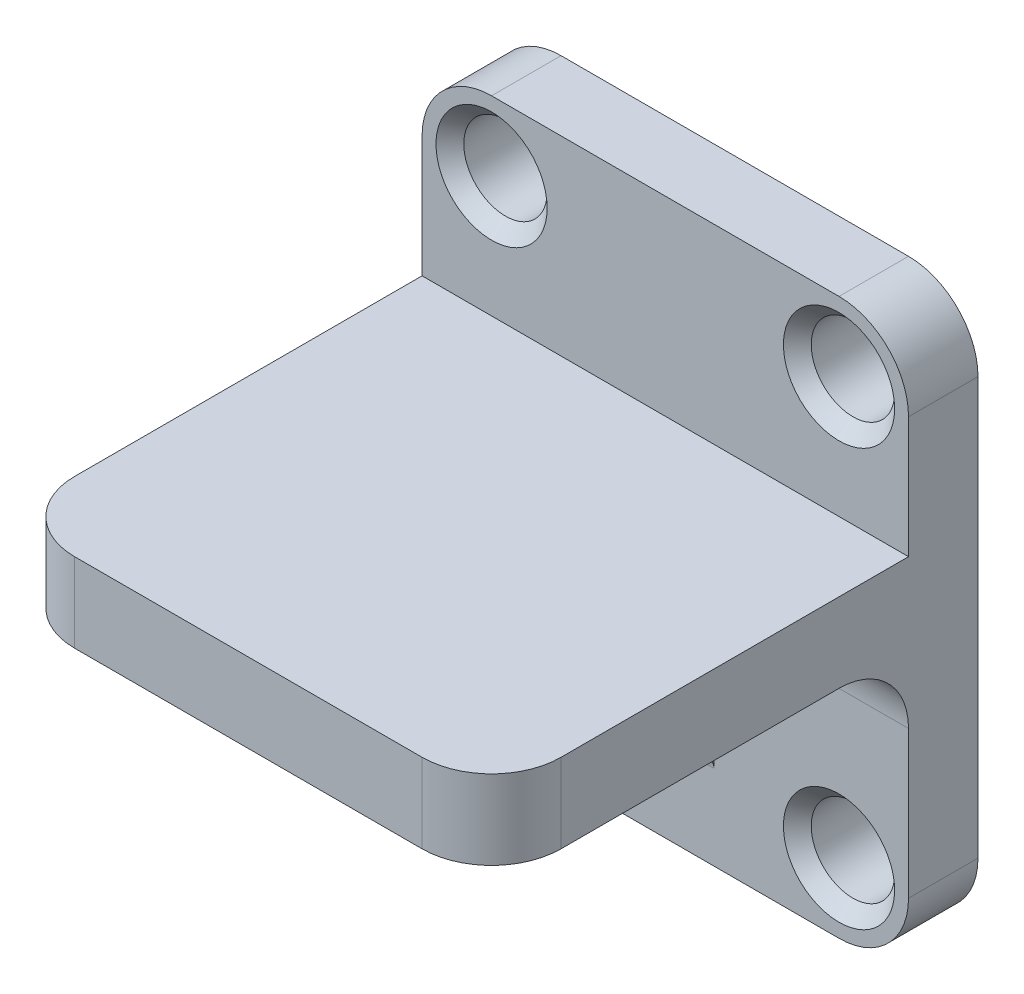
ISO-10303-21;
HEADER;
FILE_DESCRIPTION(('STEP AP214'),'2;1');
FILE_NAME('part.step','',(''),(''),'','','');
FILE_SCHEMA(('AUTOMOTIVE_DESIGN { 1 0 10303 214 1 1 1 1 }'));
ENDSEC;
DATA;
#1=APPLICATION_CONTEXT('core data for automotive mechanical design processes');
#2=APPLICATION_PROTOCOL_DEFINITION('international standard','automotive_design',2000,#1);
#3=PRODUCT_CONTEXT('',#1,'mechanical');
#4=PRODUCT('Part','Part','',(#3));
#5=PRODUCT_RELATED_PRODUCT_CATEGORY('part','',(#4));
#6=PRODUCT_DEFINITION_FORMATION('','',#4);
#7=PRODUCT_DEFINITION_CONTEXT('part definition',#1,'design');
#8=PRODUCT_DEFINITION('design','',#6,#7);
#9=PRODUCT_DEFINITION_SHAPE('','',#8);
#10=(LENGTH_UNIT() NAMED_UNIT(*) SI_UNIT(.MILLI.,.METRE.));
#11=(NAMED_UNIT(*) PLANE_ANGLE_UNIT() SI_UNIT($,.RADIAN.));
#12=(NAMED_UNIT(*) SI_UNIT($,.STERADIAN.) SOLID_ANGLE_UNIT());
#13=UNCERTAINTY_MEASURE_WITH_UNIT(LENGTH_MEASURE(1.E-05),#10,'distance_accuracy_value','');
#14=(GEOMETRIC_REPRESENTATION_CONTEXT(3) GLOBAL_UNCERTAINTY_ASSIGNED_CONTEXT((#13)) GLOBAL_UNIT_ASSIGNED_CONTEXT((#10,
#11,#12)) REPRESENTATION_CONTEXT('',''));
#15=CARTESIAN_POINT('',(0.,0.,0.));
#16=DIRECTION('',(0.,0.,1.));
#17=DIRECTION('',(1.,0.,0.));
#18=AXIS2_PLACEMENT_3D('',#15,#16,#17);
#19=CARTESIAN_POINT('',(60.,70.,10.));
#20=DIRECTION('',(0.,0.,1.));
#21=DIRECTION('',(1.,0.,0.));
#22=AXIS2_PLACEMENT_3D('',#19,#20,#21);
#23=PLANE('',#22);
#24=DIRECTION('',(0.,-1.,0.));
#25=VECTOR('',#24,1.);
#26=CARTESIAN_POINT('',(0.,10.0000000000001,10.));
#27=LINE('',#26,#25);
#28=CARTESIAN_POINT('',(0.,69.9999999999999,10.));
#29=VERTEX_POINT('',#28);
#30=CARTESIAN_POINT('',(0.,52.5636894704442,10.));
#31=VERTEX_POINT('',#30);
#32=EDGE_CURVE('E270',#29,#31,#27,.T.);
#33=ORIENTED_EDGE('',*,*,#32,.T.);
#34=DIRECTION('',(-1.,0.,0.));
#35=VECTOR('',#34,1.);
#36=CARTESIAN_POINT('',(0.,52.5636894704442,10.));
#37=LINE('',#36,#35);
#38=CARTESIAN_POINT('',(70.,52.5636894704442,10.));
#39=VERTEX_POINT('',#38);
#40=EDGE_CURVE('E189',#39,#31,#37,.T.);
#41=ORIENTED_EDGE('',*,*,#40,.F.);
#42=DIRECTION('',(0.,1.,0.));
#43=VECTOR('',#42,1.);
#44=CARTESIAN_POINT('',(70.,10.0000000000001,10.));
#45=LINE('',#44,#43);
#46=CARTESIAN_POINT('',(70.,69.9999999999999,10.));
#47=VERTEX_POINT('',#46);
#48=EDGE_CURVE('E291',#39,#47,#45,.T.);
#49=ORIENTED_EDGE('',*,*,#48,.T.);
#50=CARTESIAN_POINT('',(60.,70.,10.));
#51=DIRECTION('',(0.,0.,1.));
#52=DIRECTION('',(1.,0.,0.));
#53=AXIS2_PLACEMENT_3D('',#50,#51,#52);
#54=CIRCLE('',#53,9.99999999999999);
#55=CARTESIAN_POINT('',(59.9999999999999,80.,10.));
#56=VERTEX_POINT('',#55);
#57=EDGE_CURVE('E315',#47,#56,#54,.T.);
#58=ORIENTED_EDGE('',*,*,#57,.T.);
#59=DIRECTION('',(-1.,0.,0.));
#60=VECTOR('',#59,1.);
#61=CARTESIAN_POINT('',(10.0000000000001,80.,10.));
#62=LINE('',#61,#60);
#63=CARTESIAN_POINT('',(10.0000000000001,80.,10.));
#64=VERTEX_POINT('',#63);
#65=EDGE_CURVE('E381',#56,#64,#62,.T.);
#66=ORIENTED_EDGE('',*,*,#65,.T.);
#67=CARTESIAN_POINT('',(10.,70.,10.));
#68=DIRECTION('',(0.,0.,1.));
#69=DIRECTION('',(-1.,0.,0.));
#70=AXIS2_PLACEMENT_3D('',#67,#68,#69);
#71=CIRCLE('',#70,10.);
#72=EDGE_CURVE('E271',#64,#29,#71,.T.);
#73=ORIENTED_EDGE('',*,*,#72,.T.);
#74=EDGE_LOOP('',(#33,#41,#49,#58,#66,#73));
#75=FACE_BOUND('',#74,.T.);
#76=CARTESIAN_POINT('',(10.,70.,10.));
#77=DIRECTION('',(0.,0.,1.));
#78=DIRECTION('',(1.,0.,0.));
#79=AXIS2_PLACEMENT_3D('',#76,#77,#78);
#80=CIRCLE('',#79,7.99999999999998);
#81=CARTESIAN_POINT('',(18.,70.,10.));
#82=VERTEX_POINT('',#81);
#83=EDGE_CURVE('E256',#82,#82,#80,.F.);
#84=ORIENTED_EDGE('',*,*,#83,.T.);
#85=EDGE_LOOP('',(#84));
#86=FACE_BOUND('',#85,.T.);
#87=CARTESIAN_POINT('',(60.,70.,10.));
#88=DIRECTION('',(0.,0.,1.));
#89=DIRECTION('',(1.,0.,0.));
#90=AXIS2_PLACEMENT_3D('',#87,#88,#89);
#91=CIRCLE('',#90,7.99999999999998);
#92=CARTESIAN_POINT('',(68.,70.,10.));
#93=VERTEX_POINT('',#92);
#94=EDGE_CURVE('E253',#93,#93,#91,.F.);
#95=ORIENTED_EDGE('',*,*,#94,.T.);
#96=EDGE_LOOP('',(#95));
#97=FACE_BOUND('',#96,.T.);
#98=ADVANCED_FACE('F32',(#75,#86,#97),#23,.T.);
#99=DIRECTION('',(0.,-1.,0.));
#100=VECTOR('',#99,1.);
#101=CARTESIAN_POINT('',(42.,70.,10.));
#102=LINE('',#101,#100);
#103=CARTESIAN_POINT('',(42.,31.1526320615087,10.));
#104=VERTEX_POINT('',#103);
#105=CARTESIAN_POINT('',(42.,12.1838850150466,10.));
#106=VERTEX_POINT('',#105);
#107=EDGE_CURVE('E47',#104,#106,#102,.T.);
#108=ORIENTED_EDGE('',*,*,#107,.T.);
#109=DIRECTION('',(-1.,0.,0.));
#110=VECTOR('',#109,1.);
#111=CARTESIAN_POINT('',(28.,12.1838850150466,10.));
#112=LINE('',#111,#110);
#113=CARTESIAN_POINT('',(28.,12.1838850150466,10.));
#114=VERTEX_POINT('',#113);
#115=EDGE_CURVE('E415',#106,#114,#112,.T.);
#116=ORIENTED_EDGE('',*,*,#115,.T.);
#117=DIRECTION('',(0.,-1.,0.));
#118=VECTOR('',#117,1.);
#119=CARTESIAN_POINT('',(28.,70.,10.));
#120=LINE('',#119,#118);
#121=CARTESIAN_POINT('',(28.,31.1526320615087,10.));
#122=VERTEX_POINT('',#121);
#123=EDGE_CURVE('E54',#122,#114,#120,.T.);
#124=ORIENTED_EDGE('',*,*,#123,.F.);
#125=DIRECTION('',(1.,0.,0.));
#126=VECTOR('',#125,1.);
#127=CARTESIAN_POINT('',(60.,31.1526320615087,10.));
#128=LINE('',#127,#126);
#129=CARTESIAN_POINT('',(0.,31.1526320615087,10.));
#130=VERTEX_POINT('',#129);
#131=EDGE_CURVE('E266',#122,#130,#128,.F.);
#132=ORIENTED_EDGE('',*,*,#131,.T.);
#133=CARTESIAN_POINT('',(0.,10.0000000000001,10.));
#134=VERTEX_POINT('',#133);
#135=EDGE_CURVE('E267',#130,#134,#27,.T.);
#136=ORIENTED_EDGE('',*,*,#135,.T.);
#137=CARTESIAN_POINT('',(10.,10.,10.));
#138=DIRECTION('',(0.,0.,1.));
#139=DIRECTION('',(-1.,0.,0.));
#140=AXIS2_PLACEMENT_3D('',#137,#138,#139);
#141=CIRCLE('',#140,10.);
#142=CARTESIAN_POINT('',(10.0000000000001,0.,10.));
#143=VERTEX_POINT('',#142);
#144=EDGE_CURVE('E277',#134,#143,#141,.T.);
#145=ORIENTED_EDGE('',*,*,#144,.T.);
#146=DIRECTION('',(1.,0.,0.));
#147=VECTOR('',#146,1.);
#148=CARTESIAN_POINT('',(10.0000000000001,0.,10.));
#149=LINE('',#148,#147);
#150=CARTESIAN_POINT('',(59.9999999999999,0.,10.));
#151=VERTEX_POINT('',#150);
#152=EDGE_CURVE('E399',#143,#151,#149,.T.);
#153=ORIENTED_EDGE('',*,*,#152,.T.);
#154=CARTESIAN_POINT('',(60.,10.,10.));
#155=DIRECTION('',(0.,0.,1.));
#156=DIRECTION('',(1.,0.,0.));
#157=AXIS2_PLACEMENT_3D('',#154,#155,#156);
#158=CIRCLE('',#157,10.);
#159=CARTESIAN_POINT('',(70.,10.0000000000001,10.));
#160=VERTEX_POINT('',#159);
#161=EDGE_CURVE('E295',#151,#160,#158,.T.);
#162=ORIENTED_EDGE('',*,*,#161,.T.);
#163=CARTESIAN_POINT('',(70.,31.1526320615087,10.));
#164=VERTEX_POINT('',#163);
#165=EDGE_CURVE('E286',#160,#164,#45,.T.);
#166=ORIENTED_EDGE('',*,*,#165,.T.);
#167=DIRECTION('',(1.,0.,0.));
#168=VECTOR('',#167,1.);
#169=CARTESIAN_POINT('',(60.,31.1526320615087,10.));
#170=LINE('',#169,#168);
#171=EDGE_CURVE('E407',#164,#104,#170,.F.);
#172=ORIENTED_EDGE('',*,*,#171,.T.);
#173=EDGE_LOOP('',(#108,#116,#124,#132,#136,#145,#153,#162,#166,#172));
#174=FACE_BOUND('',#173,.T.);
#175=CARTESIAN_POINT('',(60.,10.,10.));
#176=DIRECTION('',(0.,0.,1.));
#177=DIRECTION('',(1.,0.,0.));
#178=AXIS2_PLACEMENT_3D('',#175,#176,#177);
#179=CIRCLE('',#178,7.99999999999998);
#180=CARTESIAN_POINT('',(68.,10.,10.));
#181=VERTEX_POINT('',#180);
#182=EDGE_CURVE('E244',#181,#181,#179,.F.);
#183=ORIENTED_EDGE('',*,*,#182,.T.);
#184=EDGE_LOOP('',(#183));
#185=FACE_BOUND('',#184,.T.);
#186=CARTESIAN_POINT('',(10.,10.,10.));
#187=DIRECTION('',(0.,0.,1.));
#188=DIRECTION('',(1.,0.,0.));
#189=AXIS2_PLACEMENT_3D('',#186,#187,#188);
#190=CIRCLE('',#189,7.99999999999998);
#191=CARTESIAN_POINT('',(18.,10.,10.));
#192=VERTEX_POINT('',#191);
#193=EDGE_CURVE('E241',#192,#192,#190,.F.);
#194=ORIENTED_EDGE('',*,*,#193,.T.);
#195=EDGE_LOOP('',(#194));
#196=FACE_BOUND('',#195,.T.);
#197=ADVANCED_FACE('F401',(#174,#185,#196),#23,.T.);
#198=CARTESIAN_POINT('',(60.,70.,0.));
#199=DIRECTION('',(0.,0.,1.));
#200=DIRECTION('',(1.,0.,0.));
#201=AXIS2_PLACEMENT_3D('',#198,#199,#200);
#202=PLANE('',#201);
#203=CARTESIAN_POINT('',(10.,10.,0.));
#204=DIRECTION('',(0.,0.,1.));
#205=DIRECTION('',(1.,0.,0.));
#206=AXIS2_PLACEMENT_3D('',#203,#204,#205);
#207=CIRCLE('',#206,6.);
#208=CARTESIAN_POINT('',(16.,10.,0.));
#209=VERTEX_POINT('',#208);
#210=EDGE_CURVE('E507',#209,#209,#207,.T.);
#211=ORIENTED_EDGE('',*,*,#210,.T.);
#212=EDGE_LOOP('',(#211));
#213=FACE_BOUND('',#212,.T.);
#214=CARTESIAN_POINT('',(10.,70.,0.));
#215=DIRECTION('',(0.,0.,1.));
#216=DIRECTION('',(1.,0.,0.));
#217=AXIS2_PLACEMENT_3D('',#214,#215,#216);
#218=CIRCLE('',#217,6.);
#219=CARTESIAN_POINT('',(16.,70.,0.));
#220=VERTEX_POINT('',#219);
#221=EDGE_CURVE('E301',#220,#220,#218,.T.);
#222=ORIENTED_EDGE('',*,*,#221,.T.);
#223=EDGE_LOOP('',(#222));
#224=FACE_BOUND('',#223,.T.);
#225=CARTESIAN_POINT('',(10.,70.,0.));
#226=DIRECTION('',(0.,0.,1.));
#227=DIRECTION('',(-1.,0.,0.));
#228=AXIS2_PLACEMENT_3D('',#225,#226,#227);
#229=CIRCLE('',#228,10.);
#230=CARTESIAN_POINT('',(10.0000000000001,80.,0.));
#231=VERTEX_POINT('',#230);
#232=CARTESIAN_POINT('',(0.,69.9999999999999,0.));
#233=VERTEX_POINT('',#232);
#234=EDGE_CURVE('E303',#231,#233,#229,.T.);
#235=ORIENTED_EDGE('',*,*,#234,.F.);
#236=DIRECTION('',(-1.,0.,0.));
#237=VECTOR('',#236,1.);
#238=CARTESIAN_POINT('',(10.0000000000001,80.,0.));
#239=LINE('',#238,#237);
#240=CARTESIAN_POINT('',(59.9999999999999,80.,0.));
#241=VERTEX_POINT('',#240);
#242=EDGE_CURVE('E300',#241,#231,#239,.T.);
#243=ORIENTED_EDGE('',*,*,#242,.F.);
#244=CARTESIAN_POINT('',(60.,70.,0.));
#245=DIRECTION('',(0.,0.,1.));
#246=DIRECTION('',(1.,0.,0.));
#247=AXIS2_PLACEMENT_3D('',#244,#245,#246);
#248=CIRCLE('',#247,9.99999999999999);
#249=CARTESIAN_POINT('',(70.,69.9999999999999,0.));
#250=VERTEX_POINT('',#249);
#251=EDGE_CURVE('E296',#250,#241,#248,.T.);
#252=ORIENTED_EDGE('',*,*,#251,.F.);
#253=DIRECTION('',(0.,1.,0.));
#254=VECTOR('',#253,1.);
#255=CARTESIAN_POINT('',(70.,10.0000000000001,0.));
#256=LINE('',#255,#254);
#257=CARTESIAN_POINT('',(70.,10.0000000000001,0.));
#258=VERTEX_POINT('',#257);
#259=EDGE_CURVE('E313',#258,#250,#256,.T.);
#260=ORIENTED_EDGE('',*,*,#259,.F.);
#261=CARTESIAN_POINT('',(60.,10.,0.));
#262=DIRECTION('',(0.,0.,1.));
#263=DIRECTION('',(1.,0.,0.));
#264=AXIS2_PLACEMENT_3D('',#261,#262,#263);
#265=CIRCLE('',#264,10.);
#266=CARTESIAN_POINT('',(59.9999999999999,0.,0.));
#267=VERTEX_POINT('',#266);
#268=EDGE_CURVE('E311',#267,#258,#265,.T.);
#269=ORIENTED_EDGE('',*,*,#268,.F.);
#270=DIRECTION('',(1.,0.,0.));
#271=VECTOR('',#270,1.);
#272=CARTESIAN_POINT('',(10.0000000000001,0.,0.));
#273=LINE('',#272,#271);
#274=CARTESIAN_POINT('',(10.0000000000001,0.,0.));
#275=VERTEX_POINT('',#274);
#276=EDGE_CURVE('E309',#275,#267,#273,.T.);
#277=ORIENTED_EDGE('',*,*,#276,.F.);
#278=CARTESIAN_POINT('',(10.,10.,0.));
#279=DIRECTION('',(0.,0.,1.));
#280=DIRECTION('',(-1.,0.,0.));
#281=AXIS2_PLACEMENT_3D('',#278,#279,#280);
#282=CIRCLE('',#281,10.);
#283=CARTESIAN_POINT('',(0.,10.0000000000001,0.));
#284=VERTEX_POINT('',#283);
#285=EDGE_CURVE('E307',#284,#275,#282,.T.);
#286=ORIENTED_EDGE('',*,*,#285,.F.);
#287=DIRECTION('',(0.,-1.,0.));
#288=VECTOR('',#287,1.);
#289=CARTESIAN_POINT('',(0.,10.0000000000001,0.));
#290=LINE('',#289,#288);
#291=EDGE_CURVE('E305',#233,#284,#290,.T.);
#292=ORIENTED_EDGE('',*,*,#291,.F.);
#293=EDGE_LOOP('',(#235,#243,#252,#260,#269,#277,#286,#292));
#294=FACE_BOUND('',#293,.T.);
#295=CARTESIAN_POINT('',(60.,70.,0.));
#296=DIRECTION('',(0.,0.,1.));
#297=DIRECTION('',(1.,0.,0.));
#298=AXIS2_PLACEMENT_3D('',#295,#296,#297);
#299=CIRCLE('',#298,6.);
#300=CARTESIAN_POINT('',(66.,70.,0.));
#301=VERTEX_POINT('',#300);
#302=EDGE_CURVE('E505',#301,#301,#299,.T.);
#303=ORIENTED_EDGE('',*,*,#302,.T.);
#304=EDGE_LOOP('',(#303));
#305=FACE_BOUND('',#304,.T.);
#306=CARTESIAN_POINT('',(60.,10.,0.));
#307=DIRECTION('',(0.,0.,1.));
#308=DIRECTION('',(1.,0.,0.));
#309=AXIS2_PLACEMENT_3D('',#306,#307,#308);
#310=CIRCLE('',#309,6.);
#311=CARTESIAN_POINT('',(66.,10.,0.));
#312=VERTEX_POINT('',#311);
#313=EDGE_CURVE('E209',#312,#312,#310,.T.);
#314=ORIENTED_EDGE('',*,*,#313,.T.);
#315=EDGE_LOOP('',(#314));
#316=FACE_BOUND('',#315,.T.);
#317=ADVANCED_FACE('F387',(#213,#224,#294,#305,#316),#202,.F.);
#318=CARTESIAN_POINT('',(60.,70.,10.));
#319=DIRECTION('',(0.,0.,-1.));
#320=DIRECTION('',(-1.,0.,0.));
#321=AXIS2_PLACEMENT_3D('',#318,#319,#320);
#322=CYLINDRICAL_SURFACE('',#321,9.99999999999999);
#323=ORIENTED_EDGE('',*,*,#251,.T.);
#324=DIRECTION('',(0.,0.,-1.));
#325=VECTOR('',#324,1.);
#326=CARTESIAN_POINT('',(59.9999999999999,80.,10.));
#327=LINE('',#326,#325);
#328=EDGE_CURVE('E284',#56,#241,#327,.T.);
#329=ORIENTED_EDGE('',*,*,#328,.F.);
#330=ORIENTED_EDGE('',*,*,#57,.F.);
#331=DIRECTION('',(0.,0.,-1.));
#332=VECTOR('',#331,1.);
#333=CARTESIAN_POINT('',(70.,69.9999999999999,10.));
#334=LINE('',#333,#332);
#335=EDGE_CURVE('E290',#47,#250,#334,.T.);
#336=ORIENTED_EDGE('',*,*,#335,.T.);
#337=EDGE_LOOP('',(#323,#329,#330,#336));
#338=FACE_BOUND('',#337,.T.);
#339=ADVANCED_FACE('F440',(#338),#322,.T.);
#340=CARTESIAN_POINT('',(10.0000000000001,80.,10.));
#341=DIRECTION('',(0.,-1.,0.));
#342=DIRECTION('',(0.,0.,-1.));
#343=AXIS2_PLACEMENT_3D('',#340,#341,#342);
#344=PLANE('',#343);
#345=DIRECTION('',(0.,0.,-1.));
#346=VECTOR('',#345,1.);
#347=CARTESIAN_POINT('',(10.0000000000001,80.,10.));
#348=LINE('',#347,#346);
#349=EDGE_CURVE('E332',#64,#231,#348,.T.);
#350=ORIENTED_EDGE('',*,*,#349,.F.);
#351=ORIENTED_EDGE('',*,*,#65,.F.);
#352=ORIENTED_EDGE('',*,*,#328,.T.);
#353=ORIENTED_EDGE('',*,*,#242,.T.);
#354=EDGE_LOOP('',(#350,#351,#352,#353));
#355=FACE_BOUND('',#354,.T.);
#356=ADVANCED_FACE('F458',(#355),#344,.F.);
#357=CARTESIAN_POINT('',(10.,70.,10.));
#358=DIRECTION('',(0.,0.,-1.));
#359=DIRECTION('',(-1.,0.,0.));
#360=AXIS2_PLACEMENT_3D('',#357,#358,#359);
#361=CYLINDRICAL_SURFACE('',#360,10.);
#362=ORIENTED_EDGE('',*,*,#234,.T.);
#363=DIRECTION('',(0.,0.,-1.));
#364=VECTOR('',#363,1.);
#365=CARTESIAN_POINT('',(0.,69.9999999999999,10.));
#366=LINE('',#365,#364);
#367=EDGE_CURVE('E330',#29,#233,#366,.T.);
#368=ORIENTED_EDGE('',*,*,#367,.F.);
#369=ORIENTED_EDGE('',*,*,#72,.F.);
#370=ORIENTED_EDGE('',*,*,#349,.T.);
#371=EDGE_LOOP('',(#362,#368,#369,#370));
#372=FACE_BOUND('',#371,.T.);
#373=ADVANCED_FACE('F382',(#372),#361,.T.);
#374=CARTESIAN_POINT('',(0.,10.0000000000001,10.));
#375=DIRECTION('',(1.,0.,0.));
#376=DIRECTION('',(0.,0.,-1.));
#377=AXIS2_PLACEMENT_3D('',#374,#375,#376);
#378=PLANE('',#377);
#379=DIRECTION('',(0.,0.,-1.));
#380=VECTOR('',#379,1.);
#381=CARTESIAN_POINT('',(0.,41.1526320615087,70.));
#382=LINE('',#381,#380);
#383=CARTESIAN_POINT('',(0.,41.1526320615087,60.));
#384=VERTEX_POINT('',#383);
#385=CARTESIAN_POINT('',(0.,41.1526320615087,20.));
#386=VERTEX_POINT('',#385);
#387=EDGE_CURVE('E353',#384,#386,#382,.T.);
#388=ORIENTED_EDGE('',*,*,#387,.F.);
#389=DIRECTION('',(0.,-1.,0.));
#390=VECTOR('',#389,1.);
#391=CARTESIAN_POINT('',(0.,52.5636894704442,60.));
#392=LINE('',#391,#390);
#393=CARTESIAN_POINT('',(0.,52.5636894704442,60.));
#394=VERTEX_POINT('',#393);
#395=EDGE_CURVE('E227',#384,#394,#392,.F.);
#396=ORIENTED_EDGE('',*,*,#395,.T.);
#397=DIRECTION('',(0.,0.,-1.));
#398=VECTOR('',#397,1.);
#399=CARTESIAN_POINT('',(0.,52.5636894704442,70.));
#400=LINE('',#399,#398);
#401=EDGE_CURVE('E206',#394,#31,#400,.T.);
#402=ORIENTED_EDGE('',*,*,#401,.T.);
#403=ORIENTED_EDGE('',*,*,#32,.F.);
#404=ORIENTED_EDGE('',*,*,#367,.T.);
#405=ORIENTED_EDGE('',*,*,#291,.T.);
#406=DIRECTION('',(0.,0.,-1.));
#407=VECTOR('',#406,1.);
#408=CARTESIAN_POINT('',(0.,10.0000000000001,10.));
#409=LINE('',#408,#407);
#410=EDGE_CURVE('E327',#134,#284,#409,.T.);
#411=ORIENTED_EDGE('',*,*,#410,.F.);
#412=ORIENTED_EDGE('',*,*,#135,.F.);
#413=CARTESIAN_POINT('',(0.,31.1526320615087,20.));
#414=DIRECTION('',(1.,0.,0.));
#415=DIRECTION('',(0.,0.,-1.));
#416=AXIS2_PLACEMENT_3D('',#413,#414,#415);
#417=CIRCLE('',#416,10.);
#418=EDGE_CURVE('E369',#130,#386,#417,.T.);
#419=ORIENTED_EDGE('',*,*,#418,.T.);
#420=EDGE_LOOP('',(#388,#396,#402,#403,#404,#405,#411,#412,#419));
#421=FACE_BOUND('',#420,.T.);
#422=ADVANCED_FACE('F365',(#421),#378,.F.);
#423=CARTESIAN_POINT('',(10.,10.,10.));
#424=DIRECTION('',(0.,0.,-1.));
#425=DIRECTION('',(-1.,0.,0.));
#426=AXIS2_PLACEMENT_3D('',#423,#424,#425);
#427=CYLINDRICAL_SURFACE('',#426,10.);
#428=ORIENTED_EDGE('',*,*,#285,.T.);
#429=DIRECTION('',(0.,0.,-1.));
#430=VECTOR('',#429,1.);
#431=CARTESIAN_POINT('',(10.0000000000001,0.,10.));
#432=LINE('',#431,#430);
#433=EDGE_CURVE('E324',#143,#275,#432,.T.);
#434=ORIENTED_EDGE('',*,*,#433,.F.);
#435=ORIENTED_EDGE('',*,*,#144,.F.);
#436=ORIENTED_EDGE('',*,*,#410,.T.);
#437=EDGE_LOOP('',(#428,#434,#435,#436));
#438=FACE_BOUND('',#437,.T.);
#439=ADVANCED_FACE('F393',(#438),#427,.T.);
#440=CARTESIAN_POINT('',(10.0000000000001,0.,10.));
#441=DIRECTION('',(0.,1.,0.));
#442=DIRECTION('',(0.,0.,1.));
#443=AXIS2_PLACEMENT_3D('',#440,#441,#442);
#444=PLANE('',#443);
#445=ORIENTED_EDGE('',*,*,#276,.T.);
#446=DIRECTION('',(0.,0.,-1.));
#447=VECTOR('',#446,1.);
#448=CARTESIAN_POINT('',(59.9999999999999,0.,10.));
#449=LINE('',#448,#447);
#450=EDGE_CURVE('E321',#151,#267,#449,.T.);
#451=ORIENTED_EDGE('',*,*,#450,.F.);
#452=ORIENTED_EDGE('',*,*,#152,.F.);
#453=ORIENTED_EDGE('',*,*,#433,.T.);
#454=EDGE_LOOP('',(#445,#451,#452,#453));
#455=FACE_BOUND('',#454,.T.);
#456=ADVANCED_FACE('F397',(#455),#444,.F.);
#457=CARTESIAN_POINT('',(60.,10.,10.));
#458=DIRECTION('',(0.,0.,-1.));
#459=DIRECTION('',(-1.,0.,0.));
#460=AXIS2_PLACEMENT_3D('',#457,#458,#459);
#461=CYLINDRICAL_SURFACE('',#460,10.);
#462=ORIENTED_EDGE('',*,*,#268,.T.);
#463=DIRECTION('',(0.,0.,-1.));
#464=VECTOR('',#463,1.);
#465=CARTESIAN_POINT('',(70.,10.0000000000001,10.));
#466=LINE('',#465,#464);
#467=EDGE_CURVE('E318',#160,#258,#466,.T.);
#468=ORIENTED_EDGE('',*,*,#467,.F.);
#469=ORIENTED_EDGE('',*,*,#161,.F.);
#470=ORIENTED_EDGE('',*,*,#450,.T.);
#471=EDGE_LOOP('',(#462,#468,#469,#470));
#472=FACE_BOUND('',#471,.T.);
#473=ADVANCED_FACE('F445',(#472),#461,.T.);
#474=CARTESIAN_POINT('',(70.,10.0000000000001,10.));
#475=DIRECTION('',(-1.,0.,0.));
#476=DIRECTION('',(0.,0.,1.));
#477=AXIS2_PLACEMENT_3D('',#474,#475,#476);
#478=PLANE('',#477);
#479=DIRECTION('',(0.,0.,-1.));
#480=VECTOR('',#479,1.);
#481=CARTESIAN_POINT('',(70.,52.5636894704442,70.));
#482=LINE('',#481,#480);
#483=CARTESIAN_POINT('',(70.,52.5636894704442,60.));
#484=VERTEX_POINT('',#483);
#485=EDGE_CURVE('E224',#484,#39,#482,.T.);
#486=ORIENTED_EDGE('',*,*,#485,.F.);
#487=DIRECTION('',(0.,1.,0.));
#488=VECTOR('',#487,1.);
#489=CARTESIAN_POINT('',(70.,41.1526320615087,60.));
#490=LINE('',#489,#488);
#491=CARTESIAN_POINT('',(70.,41.1526320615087,60.));
#492=VERTEX_POINT('',#491);
#493=EDGE_CURVE('E236',#484,#492,#490,.F.);
#494=ORIENTED_EDGE('',*,*,#493,.T.);
#495=DIRECTION('',(0.,0.,-1.));
#496=VECTOR('',#495,1.);
#497=CARTESIAN_POINT('',(70.,41.1526320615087,70.));
#498=LINE('',#497,#496);
#499=CARTESIAN_POINT('',(70.,41.1526320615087,20.));
#500=VERTEX_POINT('',#499);
#501=EDGE_CURVE('E231',#492,#500,#498,.T.);
#502=ORIENTED_EDGE('',*,*,#501,.T.);
#503=CARTESIAN_POINT('',(70.,31.1526320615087,20.));
#504=DIRECTION('',(-1.,0.,0.));
#505=DIRECTION('',(0.,0.,1.));
#506=AXIS2_PLACEMENT_3D('',#503,#504,#505);
#507=CIRCLE('',#506,10.);
#508=EDGE_CURVE('E412',#500,#164,#507,.T.);
#509=ORIENTED_EDGE('',*,*,#508,.T.);
#510=ORIENTED_EDGE('',*,*,#165,.F.);
#511=ORIENTED_EDGE('',*,*,#467,.T.);
#512=ORIENTED_EDGE('',*,*,#259,.T.);
#513=ORIENTED_EDGE('',*,*,#335,.F.);
#514=ORIENTED_EDGE('',*,*,#48,.F.);
#515=EDGE_LOOP('',(#486,#494,#502,#509,#510,#511,#512,#513,#514));
#516=FACE_BOUND('',#515,.T.);
#517=ADVANCED_FACE('F442',(#516),#478,.F.);
#518=CARTESIAN_POINT('',(10.,70.,10.));
#519=DIRECTION('',(0.,0.,-1.));
#520=DIRECTION('',(-1.,0.,0.));
#521=AXIS2_PLACEMENT_3D('',#518,#519,#520);
#522=CYLINDRICAL_SURFACE('',#521,6.);
#523=CARTESIAN_POINT('',(10.,70.,8.00000000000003));
#524=DIRECTION('',(0.,0.,1.));
#525=DIRECTION('',(1.,0.,0.));
#526=AXIS2_PLACEMENT_3D('',#523,#524,#525);
#527=CIRCLE('',#526,6.);
#528=CARTESIAN_POINT('',(16.,70.,8.00000000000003));
#529=VERTEX_POINT('',#528);
#530=EDGE_CURVE('E250',#529,#529,#527,.T.);
#531=ORIENTED_EDGE('',*,*,#530,.T.);
#532=EDGE_LOOP('',(#531));
#533=FACE_BOUND('',#532,.T.);
#534=ORIENTED_EDGE('',*,*,#221,.F.);
#535=EDGE_LOOP('',(#534));
#536=FACE_BOUND('',#535,.T.);
#537=ADVANCED_FACE('F436',(#533,#536),#522,.F.);
#538=CARTESIAN_POINT('',(60.,70.,10.));
#539=DIRECTION('',(0.,0.,-1.));
#540=DIRECTION('',(-1.,0.,0.));
#541=AXIS2_PLACEMENT_3D('',#538,#539,#540);
#542=CYLINDRICAL_SURFACE('',#541,6.);
#543=CARTESIAN_POINT('',(60.,70.,8.00000000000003));
#544=DIRECTION('',(0.,0.,1.));
#545=DIRECTION('',(1.,0.,0.));
#546=AXIS2_PLACEMENT_3D('',#543,#544,#545);
#547=CIRCLE('',#546,6.);
#548=CARTESIAN_POINT('',(66.,70.,8.00000000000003));
#549=VERTEX_POINT('',#548);
#550=EDGE_CURVE('E259',#549,#549,#547,.T.);
#551=ORIENTED_EDGE('',*,*,#550,.T.);
#552=EDGE_LOOP('',(#551));
#553=FACE_BOUND('',#552,.T.);
#554=ORIENTED_EDGE('',*,*,#302,.F.);
#555=EDGE_LOOP('',(#554));
#556=FACE_BOUND('',#555,.T.);
#557=ADVANCED_FACE('F524',(#553,#556),#542,.F.);
#558=CARTESIAN_POINT('',(10.,10.,10.));
#559=DIRECTION('',(0.,0.,-1.));
#560=DIRECTION('',(-1.,0.,0.));
#561=AXIS2_PLACEMENT_3D('',#558,#559,#560);
#562=CYLINDRICAL_SURFACE('',#561,6.);
#563=CARTESIAN_POINT('',(10.,10.,8.00000000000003));
#564=DIRECTION('',(0.,0.,1.));
#565=DIRECTION('',(1.,0.,0.));
#566=AXIS2_PLACEMENT_3D('',#563,#564,#565);
#567=CIRCLE('',#566,6.);
#568=CARTESIAN_POINT('',(16.,10.,8.00000000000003));
#569=VERTEX_POINT('',#568);
#570=EDGE_CURVE('E247',#569,#569,#567,.T.);
#571=ORIENTED_EDGE('',*,*,#570,.T.);
#572=EDGE_LOOP('',(#571));
#573=FACE_BOUND('',#572,.T.);
#574=ORIENTED_EDGE('',*,*,#210,.F.);
#575=EDGE_LOOP('',(#574));
#576=FACE_BOUND('',#575,.T.);
#577=ADVANCED_FACE('F516',(#573,#576),#562,.F.);
#578=CARTESIAN_POINT('',(60.,10.,10.));
#579=DIRECTION('',(0.,0.,-1.));
#580=DIRECTION('',(-1.,0.,0.));
#581=AXIS2_PLACEMENT_3D('',#578,#579,#580);
#582=CYLINDRICAL_SURFACE('',#581,6.);
#583=CARTESIAN_POINT('',(60.,10.,8.00000000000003));
#584=DIRECTION('',(0.,0.,1.));
#585=DIRECTION('',(1.,0.,0.));
#586=AXIS2_PLACEMENT_3D('',#583,#584,#585);
#587=CIRCLE('',#586,6.);
#588=CARTESIAN_POINT('',(66.,10.,8.00000000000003));
#589=VERTEX_POINT('',#588);
#590=EDGE_CURVE('E238',#589,#589,#587,.T.);
#591=ORIENTED_EDGE('',*,*,#590,.T.);
#592=EDGE_LOOP('',(#591));
#593=FACE_BOUND('',#592,.T.);
#594=ORIENTED_EDGE('',*,*,#313,.F.);
#595=EDGE_LOOP('',(#594));
#596=FACE_BOUND('',#595,.T.);
#597=ADVANCED_FACE('F514',(#593,#596),#582,.F.);
#598=CARTESIAN_POINT('',(0.,41.1526320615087,70.));
#599=DIRECTION('',(0.,1.,0.));
#600=DIRECTION('',(0.,0.,1.));
#601=AXIS2_PLACEMENT_3D('',#598,#599,#600);
#602=PLANE('',#601);
#603=DIRECTION('',(0.,0.,1.));
#604=VECTOR('',#603,1.);
#605=CARTESIAN_POINT('',(42.,41.1526320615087,70.));
#606=LINE('',#605,#604);
#607=CARTESIAN_POINT('',(42.,41.1526320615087,20.));
#608=VERTEX_POINT('',#607);
#609=CARTESIAN_POINT('',(42.,41.1526320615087,58.9363087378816));
#610=VERTEX_POINT('',#609);
#611=EDGE_CURVE('E168',#608,#610,#606,.T.);
#612=ORIENTED_EDGE('',*,*,#611,.F.);
#613=DIRECTION('',(1.,0.,0.));
#614=VECTOR('',#613,1.);
#615=CARTESIAN_POINT('',(0.,41.1526320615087,20.));
#616=LINE('',#615,#614);
#617=EDGE_CURVE('E406',#608,#500,#616,.T.);
#618=ORIENTED_EDGE('',*,*,#617,.T.);
#619=ORIENTED_EDGE('',*,*,#501,.F.);
#620=CARTESIAN_POINT('',(60.,41.1526320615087,60.));
#621=DIRECTION('',(0.,1.,0.));
#622=DIRECTION('',(0.,0.,1.));
#623=AXIS2_PLACEMENT_3D('',#620,#621,#622);
#624=CIRCLE('',#623,10.);
#625=CARTESIAN_POINT('',(60.,41.1526320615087,70.));
#626=VERTEX_POINT('',#625);
#627=EDGE_CURVE('E348',#492,#626,#624,.F.);
#628=ORIENTED_EDGE('',*,*,#627,.T.);
#629=DIRECTION('',(1.,0.,0.));
#630=VECTOR('',#629,1.);
#631=CARTESIAN_POINT('',(0.,41.1526320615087,70.));
#632=LINE('',#631,#630);
#633=CARTESIAN_POINT('',(10.,41.1526320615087,70.));
#634=VERTEX_POINT('',#633);
#635=EDGE_CURVE('E201',#634,#626,#632,.T.);
#636=ORIENTED_EDGE('',*,*,#635,.F.);
#637=CARTESIAN_POINT('',(10.,41.1526320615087,60.));
#638=DIRECTION('',(0.,1.,0.));
#639=DIRECTION('',(0.,0.,1.));
#640=AXIS2_PLACEMENT_3D('',#637,#638,#639);
#641=CIRCLE('',#640,10.);
#642=EDGE_CURVE('E225',#634,#384,#641,.F.);
#643=ORIENTED_EDGE('',*,*,#642,.T.);
#644=ORIENTED_EDGE('',*,*,#387,.T.);
#645=DIRECTION('',(1.,0.,0.));
#646=VECTOR('',#645,1.);
#647=CARTESIAN_POINT('',(0.,41.1526320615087,20.));
#648=LINE('',#647,#646);
#649=CARTESIAN_POINT('',(28.,41.1526320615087,20.));
#650=VERTEX_POINT('',#649);
#651=EDGE_CURVE('E262',#386,#650,#648,.T.);
#652=ORIENTED_EDGE('',*,*,#651,.T.);
#653=DIRECTION('',(0.,0.,1.));
#654=VECTOR('',#653,1.);
#655=CARTESIAN_POINT('',(28.,41.1526320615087,70.));
#656=LINE('',#655,#654);
#657=CARTESIAN_POINT('',(28.,41.1526320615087,58.9363087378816));
#658=VERTEX_POINT('',#657);
#659=EDGE_CURVE('E185',#650,#658,#656,.T.);
#660=ORIENTED_EDGE('',*,*,#659,.T.);
#661=DIRECTION('',(-1.,0.,0.));
#662=VECTOR('',#661,1.);
#663=CARTESIAN_POINT('',(0.,41.1526320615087,58.9363087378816));
#664=LINE('',#663,#662);
#665=EDGE_CURVE('E181',#658,#610,#664,.F.);
#666=ORIENTED_EDGE('',*,*,#665,.T.);
#667=EDGE_LOOP('',(#612,#618,#619,#628,#636,#643,#644,#652,#660,#666));
#668=FACE_BOUND('',#667,.T.);
#669=ADVANCED_FACE('F182',(#668),#602,.F.);
#670=CARTESIAN_POINT('',(0.,52.5636894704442,70.));
#671=DIRECTION('',(0.,-1.,0.));
#672=DIRECTION('',(0.,0.,-1.));
#673=AXIS2_PLACEMENT_3D('',#670,#671,#672);
#674=PLANE('',#673);
#675=CARTESIAN_POINT('',(10.,52.5636894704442,60.));
#676=DIRECTION('',(0.,-1.,0.));
#677=DIRECTION('',(0.,0.,-1.));
#678=AXIS2_PLACEMENT_3D('',#675,#676,#677);
#679=CIRCLE('',#678,10.);
#680=CARTESIAN_POINT('',(10.,52.5636894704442,70.));
#681=VERTEX_POINT('',#680);
#682=EDGE_CURVE('E233',#394,#681,#679,.F.);
#683=ORIENTED_EDGE('',*,*,#682,.T.);
#684=DIRECTION('',(-1.,0.,0.));
#685=VECTOR('',#684,1.);
#686=CARTESIAN_POINT('',(0.,52.5636894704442,70.));
#687=LINE('',#686,#685);
#688=CARTESIAN_POINT('',(60.,52.5636894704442,70.));
#689=VERTEX_POINT('',#688);
#690=EDGE_CURVE('E204',#689,#681,#687,.T.);
#691=ORIENTED_EDGE('',*,*,#690,.F.);
#692=CARTESIAN_POINT('',(60.,52.5636894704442,60.));
#693=DIRECTION('',(0.,-1.,0.));
#694=DIRECTION('',(0.,0.,-1.));
#695=AXIS2_PLACEMENT_3D('',#692,#693,#694);
#696=CIRCLE('',#695,10.);
#697=EDGE_CURVE('E229',#689,#484,#696,.F.);
#698=ORIENTED_EDGE('',*,*,#697,.T.);
#699=ORIENTED_EDGE('',*,*,#485,.T.);
#700=ORIENTED_EDGE('',*,*,#40,.T.);
#701=ORIENTED_EDGE('',*,*,#401,.F.);
#702=EDGE_LOOP('',(#683,#691,#698,#699,#700,#701));
#703=FACE_BOUND('',#702,.T.);
#704=ADVANCED_FACE('F373',(#703),#674,.F.);
#705=CARTESIAN_POINT('',(0.,41.1526320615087,70.));
#706=DIRECTION('',(0.,0.,1.));
#707=DIRECTION('',(1.,0.,0.));
#708=AXIS2_PLACEMENT_3D('',#705,#706,#707);
#709=PLANE('',#708);
#710=ORIENTED_EDGE('',*,*,#690,.T.);
#711=DIRECTION('',(0.,-1.,0.));
#712=VECTOR('',#711,1.);
#713=CARTESIAN_POINT('',(10.,41.1526320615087,70.));
#714=LINE('',#713,#712);
#715=EDGE_CURVE('E343',#681,#634,#714,.T.);
#716=ORIENTED_EDGE('',*,*,#715,.T.);
#717=ORIENTED_EDGE('',*,*,#635,.T.);
#718=DIRECTION('',(0.,1.,0.));
#719=VECTOR('',#718,1.);
#720=CARTESIAN_POINT('',(60.,52.5636894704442,70.));
#721=LINE('',#720,#719);
#722=EDGE_CURVE('E339',#626,#689,#721,.T.);
#723=ORIENTED_EDGE('',*,*,#722,.T.);
#724=EDGE_LOOP('',(#710,#716,#717,#723));
#725=FACE_BOUND('',#724,.T.);
#726=ADVANCED_FACE('F467',(#725),#709,.T.);
#727=CARTESIAN_POINT('',(10.,41.1526320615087,60.));
#728=DIRECTION('',(0.,1.,0.));
#729=DIRECTION('',(0.,0.,1.));
#730=AXIS2_PLACEMENT_3D('',#727,#728,#729);
#731=CYLINDRICAL_SURFACE('',#730,10.);
#732=ORIENTED_EDGE('',*,*,#682,.F.);
#733=ORIENTED_EDGE('',*,*,#395,.F.);
#734=ORIENTED_EDGE('',*,*,#642,.F.);
#735=ORIENTED_EDGE('',*,*,#715,.F.);
#736=EDGE_LOOP('',(#732,#733,#734,#735));
#737=FACE_BOUND('',#736,.T.);
#738=ADVANCED_FACE('F371',(#737),#731,.T.);
#739=CARTESIAN_POINT('',(60.,41.1526320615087,60.));
#740=DIRECTION('',(0.,-1.,0.));
#741=DIRECTION('',(0.,0.,-1.));
#742=AXIS2_PLACEMENT_3D('',#739,#740,#741);
#743=CYLINDRICAL_SURFACE('',#742,10.);
#744=ORIENTED_EDGE('',*,*,#627,.F.);
#745=ORIENTED_EDGE('',*,*,#493,.F.);
#746=ORIENTED_EDGE('',*,*,#697,.F.);
#747=ORIENTED_EDGE('',*,*,#722,.F.);
#748=EDGE_LOOP('',(#744,#745,#746,#747));
#749=FACE_BOUND('',#748,.T.);
#750=ADVANCED_FACE('F466',(#749),#743,.T.);
#751=CARTESIAN_POINT('',(60.,10.,8.00000000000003));
#752=DIRECTION('',(0.,0.,1.));
#753=DIRECTION('',(1.,0.,0.));
#754=AXIS2_PLACEMENT_3D('',#751,#752,#753);
#755=CONICAL_SURFACE('',#754,6.,0.785398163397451);
#756=ORIENTED_EDGE('',*,*,#182,.F.);
#757=EDGE_LOOP('',(#756));
#758=FACE_BOUND('',#757,.T.);
#759=ORIENTED_EDGE('',*,*,#590,.F.);
#760=EDGE_LOOP('',(#759));
#761=FACE_BOUND('',#760,.T.);
#762=ADVANCED_FACE('F470',(#758,#761),#755,.F.);
#763=CARTESIAN_POINT('',(10.,10.,8.00000000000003));
#764=DIRECTION('',(0.,0.,1.));
#765=DIRECTION('',(1.,0.,0.));
#766=AXIS2_PLACEMENT_3D('',#763,#764,#765);
#767=CONICAL_SURFACE('',#766,6.,0.785398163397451);
#768=ORIENTED_EDGE('',*,*,#193,.F.);
#769=EDGE_LOOP('',(#768));
#770=FACE_BOUND('',#769,.T.);
#771=ORIENTED_EDGE('',*,*,#570,.F.);
#772=EDGE_LOOP('',(#771));
#773=FACE_BOUND('',#772,.T.);
#774=ADVANCED_FACE('F474',(#770,#773),#767,.F.);
#775=CARTESIAN_POINT('',(10.,70.,8.00000000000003));
#776=DIRECTION('',(0.,0.,1.));
#777=DIRECTION('',(1.,0.,0.));
#778=AXIS2_PLACEMENT_3D('',#775,#776,#777);
#779=CONICAL_SURFACE('',#778,6.,0.78539816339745);
#780=ORIENTED_EDGE('',*,*,#83,.F.);
#781=EDGE_LOOP('',(#780));
#782=FACE_BOUND('',#781,.T.);
#783=ORIENTED_EDGE('',*,*,#530,.F.);
#784=EDGE_LOOP('',(#783));
#785=FACE_BOUND('',#784,.T.);
#786=ADVANCED_FACE('F478',(#782,#785),#779,.F.);
#787=CARTESIAN_POINT('',(60.,70.,8.00000000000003));
#788=DIRECTION('',(0.,0.,1.));
#789=DIRECTION('',(1.,0.,0.));
#790=AXIS2_PLACEMENT_3D('',#787,#788,#789);
#791=CONICAL_SURFACE('',#790,6.,0.78539816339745);
#792=ORIENTED_EDGE('',*,*,#94,.F.);
#793=EDGE_LOOP('',(#792));
#794=FACE_BOUND('',#793,.T.);
#795=ORIENTED_EDGE('',*,*,#550,.F.);
#796=EDGE_LOOP('',(#795));
#797=FACE_BOUND('',#796,.T.);
#798=ADVANCED_FACE('F427',(#794,#797),#791,.F.);
#799=CARTESIAN_POINT('',(35.,44.8410546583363,65.4279081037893));
#800=DIRECTION('',(0.,0.869455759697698,-0.494010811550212));
#801=DIRECTION('',(0.,-0.494010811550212,-0.869455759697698));
#802=AXIS2_PLACEMENT_3D('',#799,#800,#801);
#803=PLANE('',#802);
#804=DIRECTION('',(0.,-0.494010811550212,-0.869455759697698));
#805=VECTOR('',#804,1.);
#806=CARTESIAN_POINT('',(28.,44.8410546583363,65.4279081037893));
#807=LINE('',#806,#805);
#808=CARTESIAN_POINT('',(28.,13.922796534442,11.0119783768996));
#809=VERTEX_POINT('',#808);
#810=EDGE_CURVE('E178',#658,#809,#807,.T.);
#811=ORIENTED_EDGE('',*,*,#810,.T.);
#812=DIRECTION('',(1.,0.,0.));
#813=VECTOR('',#812,1.);
#814=CARTESIAN_POINT('',(42.,13.922796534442,11.0119783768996));
#815=LINE('',#814,#813);
#816=CARTESIAN_POINT('',(42.,13.922796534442,11.0119783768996));
#817=VERTEX_POINT('',#816);
#818=EDGE_CURVE('E194',#809,#817,#815,.T.);
#819=ORIENTED_EDGE('',*,*,#818,.T.);
#820=DIRECTION('',(0.,-0.494010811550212,-0.869455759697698));
#821=VECTOR('',#820,1.);
#822=CARTESIAN_POINT('',(42.,44.8410546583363,65.4279081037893));
#823=LINE('',#822,#821);
#824=EDGE_CURVE('E172',#610,#817,#823,.T.);
#825=ORIENTED_EDGE('',*,*,#824,.F.);
#826=ORIENTED_EDGE('',*,*,#665,.F.);
#827=EDGE_LOOP('',(#811,#819,#825,#826));
#828=FACE_BOUND('',#827,.T.);
#829=ADVANCED_FACE('F192',(#828),#803,.F.);
#830=CARTESIAN_POINT('',(28.,40.,35.));
#831=DIRECTION('',(-1.,0.,0.));
#832=DIRECTION('',(0.,0.,1.));
#833=AXIS2_PLACEMENT_3D('',#830,#831,#832);
#834=PLANE('',#833);
#835=ORIENTED_EDGE('',*,*,#659,.F.);
#836=CARTESIAN_POINT('',(28.,31.1526320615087,20.));
#837=DIRECTION('',(-1.,0.,0.));
#838=DIRECTION('',(0.,0.,1.));
#839=AXIS2_PLACEMENT_3D('',#836,#837,#838);
#840=CIRCLE('',#839,10.);
#841=EDGE_CURVE('E264',#650,#122,#840,.T.);
#842=ORIENTED_EDGE('',*,*,#841,.T.);
#843=ORIENTED_EDGE('',*,*,#123,.T.);
#844=CARTESIAN_POINT('',(28.,12.1838850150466,12.));
#845=DIRECTION('',(-1.,0.,0.));
#846=DIRECTION('',(0.,0.,1.));
#847=AXIS2_PLACEMENT_3D('',#844,#845,#846);
#848=CIRCLE('',#847,2.);
#849=EDGE_CURVE('E11',#114,#809,#848,.F.);
#850=ORIENTED_EDGE('',*,*,#849,.T.);
#851=ORIENTED_EDGE('',*,*,#810,.F.);
#852=EDGE_LOOP('',(#835,#842,#843,#850,#851));
#853=FACE_BOUND('',#852,.T.);
#854=ADVANCED_FACE('F419',(#853),#834,.T.);
#855=CARTESIAN_POINT('',(42.,40.,35.));
#856=DIRECTION('',(-1.,0.,0.));
#857=DIRECTION('',(0.,0.,1.));
#858=AXIS2_PLACEMENT_3D('',#855,#856,#857);
#859=PLANE('',#858);
#860=ORIENTED_EDGE('',*,*,#107,.F.);
#861=CARTESIAN_POINT('',(42.,31.1526320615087,20.));
#862=DIRECTION('',(-1.,0.,0.));
#863=DIRECTION('',(0.,0.,1.));
#864=AXIS2_PLACEMENT_3D('',#861,#862,#863);
#865=CIRCLE('',#864,10.);
#866=EDGE_CURVE('E174',#104,#608,#865,.F.);
#867=ORIENTED_EDGE('',*,*,#866,.T.);
#868=ORIENTED_EDGE('',*,*,#611,.T.);
#869=ORIENTED_EDGE('',*,*,#824,.T.);
#870=CARTESIAN_POINT('',(42.,12.1838850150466,12.));
#871=DIRECTION('',(-1.,0.,0.));
#872=DIRECTION('',(0.,0.,1.));
#873=AXIS2_PLACEMENT_3D('',#870,#871,#872);
#874=CIRCLE('',#873,2.);
#875=EDGE_CURVE('E40',#817,#106,#874,.T.);
#876=ORIENTED_EDGE('',*,*,#875,.T.);
#877=EDGE_LOOP('',(#860,#867,#868,#869,#876));
#878=FACE_BOUND('',#877,.T.);
#879=ADVANCED_FACE('F170',(#878),#859,.F.);
#880=CARTESIAN_POINT('',(0.,31.1526320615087,20.));
#881=DIRECTION('',(1.,0.,0.));
#882=DIRECTION('',(0.,0.,-1.));
#883=AXIS2_PLACEMENT_3D('',#880,#881,#882);
#884=CYLINDRICAL_SURFACE('',#883,10.);
#885=ORIENTED_EDGE('',*,*,#418,.F.);
#886=ORIENTED_EDGE('',*,*,#131,.F.);
#887=ORIENTED_EDGE('',*,*,#841,.F.);
#888=ORIENTED_EDGE('',*,*,#651,.F.);
#889=EDGE_LOOP('',(#885,#886,#887,#888));
#890=FACE_BOUND('',#889,.T.);
#891=ADVANCED_FACE('F405',(#890),#884,.F.);
#892=CARTESIAN_POINT('',(0.,31.1526320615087,20.));
#893=DIRECTION('',(1.,0.,0.));
#894=DIRECTION('',(0.,0.,-1.));
#895=AXIS2_PLACEMENT_3D('',#892,#893,#894);
#896=CYLINDRICAL_SURFACE('',#895,10.);
#897=ORIENTED_EDGE('',*,*,#866,.F.);
#898=ORIENTED_EDGE('',*,*,#171,.F.);
#899=ORIENTED_EDGE('',*,*,#508,.F.);
#900=ORIENTED_EDGE('',*,*,#617,.F.);
#901=EDGE_LOOP('',(#897,#898,#899,#900));
#902=FACE_BOUND('',#901,.T.);
#903=ADVANCED_FACE('F487',(#902),#896,.F.);
#904=CARTESIAN_POINT('',(35.,12.1838850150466,12.));
#905=DIRECTION('',(1.,0.,0.));
#906=DIRECTION('',(0.,0.,-1.));
#907=AXIS2_PLACEMENT_3D('',#904,#905,#906);
#908=CYLINDRICAL_SURFACE('',#907,2.);
#909=ORIENTED_EDGE('',*,*,#849,.F.);
#910=ORIENTED_EDGE('',*,*,#115,.F.);
#911=ORIENTED_EDGE('',*,*,#875,.F.);
#912=ORIENTED_EDGE('',*,*,#818,.F.);
#913=EDGE_LOOP('',(#909,#910,#911,#912));
#914=FACE_BOUND('',#913,.T.);
#915=ADVANCED_FACE('F34',(#914),#908,.F.);
#916=CLOSED_SHELL('',(#98,#197,#317,#339,#356,#373,#422,#439,#456,#473,#517,#537,#557,#577,#597,
#669,#704,#726,#738,#750,#762,#774,#786,#798,#829,#854,#879,#891,#903,#915));
#917=MANIFOLD_SOLID_BREP('B2',#916);
#918=ADVANCED_BREP_SHAPE_REPRESENTATION('',(#18,#917),#14);
#919=SHAPE_DEFINITION_REPRESENTATION(#9,#918);
ENDSEC;
END-ISO-10303-21;
